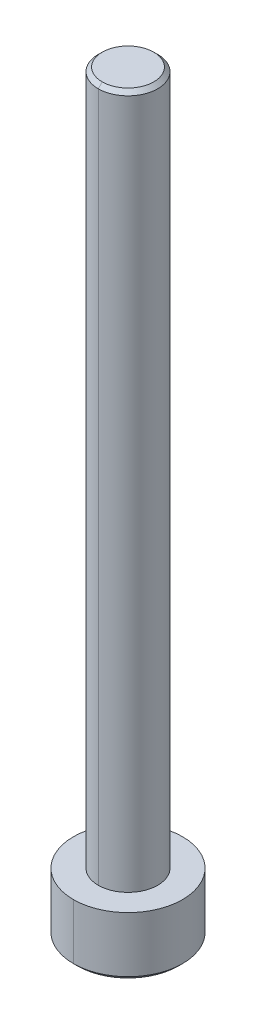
ISO-10303-21;
HEADER;
FILE_DESCRIPTION(('STEP AP214'),'2;1');
FILE_NAME('part.step','',(''),(''),'','','');
FILE_SCHEMA(('AUTOMOTIVE_DESIGN { 1 0 10303 214 1 1 1 1 }'));
ENDSEC;
DATA;
#1=APPLICATION_CONTEXT('core data for automotive mechanical design processes');
#2=APPLICATION_PROTOCOL_DEFINITION('international standard','automotive_design',2000,#1);
#3=PRODUCT_CONTEXT('',#1,'mechanical');
#4=PRODUCT('Part','Part','',(#3));
#5=PRODUCT_RELATED_PRODUCT_CATEGORY('part','',(#4));
#6=PRODUCT_DEFINITION_FORMATION('','',#4);
#7=PRODUCT_DEFINITION_CONTEXT('part definition',#1,'design');
#8=PRODUCT_DEFINITION('design','',#6,#7);
#9=PRODUCT_DEFINITION_SHAPE('','',#8);
#10=(LENGTH_UNIT() NAMED_UNIT(*) SI_UNIT(.MILLI.,.METRE.));
#11=(NAMED_UNIT(*) PLANE_ANGLE_UNIT() SI_UNIT($,.RADIAN.));
#12=(NAMED_UNIT(*) SI_UNIT($,.STERADIAN.) SOLID_ANGLE_UNIT());
#13=UNCERTAINTY_MEASURE_WITH_UNIT(LENGTH_MEASURE(1.E-05),#10,'distance_accuracy_value','');
#14=(GEOMETRIC_REPRESENTATION_CONTEXT(3) GLOBAL_UNCERTAINTY_ASSIGNED_CONTEXT((#13)) GLOBAL_UNIT_ASSIGNED_CONTEXT((#10,
#11,#12)) REPRESENTATION_CONTEXT('',''));
#15=CARTESIAN_POINT('',(0.,0.,0.));
#16=DIRECTION('',(0.,0.,1.));
#17=DIRECTION('',(1.,0.,0.));
#18=AXIS2_PLACEMENT_3D('',#15,#16,#17);
#19=CARTESIAN_POINT('',(-27.97508868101,-72.,27.975088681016));
#20=DIRECTION('',(0.,-1.,0.));
#21=DIRECTION('',(-1.,0.,0.));
#22=AXIS2_PLACEMENT_3D('',#19,#20,#21);
#23=PLANE('',#22);
#24=DIRECTION('',(-0.50000000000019,0.,-0.866025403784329));
#25=VECTOR('',#24,1.);
#26=CARTESIAN_POINT('',(-27.25340084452,-72.,26.725088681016));
#27=LINE('',#26,#25);
#28=CARTESIAN_POINT('',(-26.53171300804,-72.,27.975088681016));
#29=VERTEX_POINT('',#28);
#30=CARTESIAN_POINT('',(-27.25340084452,-72.,26.725088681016));
#31=VERTEX_POINT('',#30);
#32=EDGE_CURVE('E215',#29,#31,#27,.T.);
#33=ORIENTED_EDGE('',*,*,#32,.F.);
#34=DIRECTION('',(0.50000000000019,0.,-0.866025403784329));
#35=VECTOR('',#34,1.);
#36=CARTESIAN_POINT('',(-26.53171300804,-72.,27.975088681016));
#37=LINE('',#36,#35);
#38=CARTESIAN_POINT('',(-27.25340084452,-72.,29.225088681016));
#39=VERTEX_POINT('',#38);
#40=EDGE_CURVE('E10',#39,#29,#37,.T.);
#41=ORIENTED_EDGE('',*,*,#40,.F.);
#42=DIRECTION('',(1.,0.,0.));
#43=VECTOR('',#42,1.);
#44=CARTESIAN_POINT('',(-27.25340084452,-72.,29.225088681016));
#45=LINE('',#44,#43);
#46=CARTESIAN_POINT('',(-28.6967765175,-72.,29.225088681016));
#47=VERTEX_POINT('',#46);
#48=EDGE_CURVE('E167',#47,#39,#45,.T.);
#49=ORIENTED_EDGE('',*,*,#48,.F.);
#50=DIRECTION('',(0.50000000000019,0.,0.866025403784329));
#51=VECTOR('',#50,1.);
#52=CARTESIAN_POINT('',(-28.6967765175,-72.,29.225088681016));
#53=LINE('',#52,#51);
#54=CARTESIAN_POINT('',(-29.41846435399,-72.,27.975088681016));
#55=VERTEX_POINT('',#54);
#56=EDGE_CURVE('E183',#55,#47,#53,.T.);
#57=ORIENTED_EDGE('',*,*,#56,.F.);
#58=DIRECTION('',(-0.50000000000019,0.,0.866025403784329));
#59=VECTOR('',#58,1.);
#60=CARTESIAN_POINT('',(-29.41846435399,-72.,27.975088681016));
#61=LINE('',#60,#59);
#62=CARTESIAN_POINT('',(-28.6967765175,-72.,26.725088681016));
#63=VERTEX_POINT('',#62);
#64=EDGE_CURVE('E207',#63,#55,#61,.T.);
#65=ORIENTED_EDGE('',*,*,#64,.F.);
#66=DIRECTION('',(-1.,0.,0.));
#67=VECTOR('',#66,1.);
#68=CARTESIAN_POINT('',(-28.6967765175,-72.,26.725088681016));
#69=LINE('',#68,#67);
#70=EDGE_CURVE('E208',#31,#63,#69,.T.);
#71=ORIENTED_EDGE('',*,*,#70,.F.);
#72=EDGE_LOOP('',(#33,#41,#49,#57,#65,#71));
#73=FACE_BOUND('',#72,.T.);
#74=ADVANCED_FACE('F16',(#73),#23,.T.);
#75=CARTESIAN_POINT('',(-26.53171300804,-72.,27.975088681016));
#76=DIRECTION('',(-0.866025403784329,0.,-0.50000000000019));
#77=DIRECTION('',(-0.50000000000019,0.,0.866025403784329));
#78=AXIS2_PLACEMENT_3D('',#75,#76,#77);
#79=PLANE('',#78);
#80=DIRECTION('',(0.50000000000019,0.,-0.866025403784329));
#81=VECTOR('',#80,1.);
#82=CARTESIAN_POINT('',(-26.53171300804,-73.5,27.975088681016));
#83=LINE('',#82,#81);
#84=CARTESIAN_POINT('',(-27.25340084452,-73.5,29.225088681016));
#85=VERTEX_POINT('',#84);
#86=CARTESIAN_POINT('',(-26.53171300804,-73.5,27.975088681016));
#87=VERTEX_POINT('',#86);
#88=EDGE_CURVE('E137',#85,#87,#83,.T.);
#89=ORIENTED_EDGE('',*,*,#88,.F.);
#90=DIRECTION('',(0.,-1.,0.));
#91=VECTOR('',#90,1.);
#92=CARTESIAN_POINT('',(-27.25340084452,-72.,29.225088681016));
#93=LINE('',#92,#91);
#94=EDGE_CURVE('E27',#39,#85,#93,.T.);
#95=ORIENTED_EDGE('',*,*,#94,.F.);
#96=ORIENTED_EDGE('',*,*,#40,.T.);
#97=DIRECTION('',(0.,-1.,0.));
#98=VECTOR('',#97,1.);
#99=CARTESIAN_POINT('',(-26.53171300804,-72.,27.975088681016));
#100=LINE('',#99,#98);
#101=EDGE_CURVE('E212',#29,#87,#100,.T.);
#102=ORIENTED_EDGE('',*,*,#101,.T.);
#103=EDGE_LOOP('',(#89,#95,#96,#102));
#104=FACE_BOUND('',#103,.T.);
#105=ADVANCED_FACE('F317',(#104),#79,.T.);
#106=CARTESIAN_POINT('',(-27.25340084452,-72.,29.225088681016));
#107=DIRECTION('',(0.,0.,-1.));
#108=DIRECTION('',(-1.,0.,0.));
#109=AXIS2_PLACEMENT_3D('',#106,#107,#108);
#110=PLANE('',#109);
#111=DIRECTION('',(1.,0.,0.));
#112=VECTOR('',#111,1.);
#113=CARTESIAN_POINT('',(-27.25340084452,-73.5,29.225088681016));
#114=LINE('',#113,#112);
#115=CARTESIAN_POINT('',(-28.6967765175,-73.5,29.225088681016));
#116=VERTEX_POINT('',#115);
#117=EDGE_CURVE('E230',#116,#85,#114,.T.);
#118=ORIENTED_EDGE('',*,*,#117,.F.);
#119=DIRECTION('',(0.,-1.,0.));
#120=VECTOR('',#119,1.);
#121=CARTESIAN_POINT('',(-28.6967765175,-72.,29.225088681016));
#122=LINE('',#121,#120);
#123=EDGE_CURVE('E170',#47,#116,#122,.T.);
#124=ORIENTED_EDGE('',*,*,#123,.F.);
#125=ORIENTED_EDGE('',*,*,#48,.T.);
#126=ORIENTED_EDGE('',*,*,#94,.T.);
#127=EDGE_LOOP('',(#118,#124,#125,#126));
#128=FACE_BOUND('',#127,.T.);
#129=ADVANCED_FACE('F264',(#128),#110,.T.);
#130=CARTESIAN_POINT('',(-28.6967765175,-72.,29.225088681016));
#131=DIRECTION('',(0.866025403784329,0.,-0.50000000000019));
#132=DIRECTION('',(0.,-1.,0.));
#133=AXIS2_PLACEMENT_3D('',#130,#131,#132);
#134=PLANE('',#133);
#135=DIRECTION('',(0.50000000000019,0.,0.866025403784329));
#136=VECTOR('',#135,1.);
#137=CARTESIAN_POINT('',(-28.6967765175,-73.5,29.225088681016));
#138=LINE('',#137,#136);
#139=CARTESIAN_POINT('',(-29.41846435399,-73.5,27.975088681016));
#140=VERTEX_POINT('',#139);
#141=EDGE_CURVE('E226',#140,#116,#138,.T.);
#142=ORIENTED_EDGE('',*,*,#141,.F.);
#143=DIRECTION('',(0.,-1.,0.));
#144=VECTOR('',#143,1.);
#145=CARTESIAN_POINT('',(-29.41846435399,-72.,27.975088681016));
#146=LINE('',#145,#144);
#147=EDGE_CURVE('E187',#55,#140,#146,.T.);
#148=ORIENTED_EDGE('',*,*,#147,.F.);
#149=ORIENTED_EDGE('',*,*,#56,.T.);
#150=ORIENTED_EDGE('',*,*,#123,.T.);
#151=EDGE_LOOP('',(#142,#148,#149,#150));
#152=FACE_BOUND('',#151,.T.);
#153=ADVANCED_FACE('F260',(#152),#134,.T.);
#154=CARTESIAN_POINT('',(-29.41846435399,-72.,27.975088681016));
#155=DIRECTION('',(0.866025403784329,0.,0.50000000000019));
#156=DIRECTION('',(0.,-1.,0.));
#157=AXIS2_PLACEMENT_3D('',#154,#155,#156);
#158=PLANE('',#157);
#159=DIRECTION('',(-0.50000000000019,0.,0.866025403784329));
#160=VECTOR('',#159,1.);
#161=CARTESIAN_POINT('',(-29.41846435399,-73.5,27.975088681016));
#162=LINE('',#161,#160);
#163=CARTESIAN_POINT('',(-28.6967765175,-73.5,26.725088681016));
#164=VERTEX_POINT('',#163);
#165=EDGE_CURVE('E161',#164,#140,#162,.T.);
#166=ORIENTED_EDGE('',*,*,#165,.F.);
#167=DIRECTION('',(0.,-1.,0.));
#168=VECTOR('',#167,1.);
#169=CARTESIAN_POINT('',(-28.6967765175,-72.,26.725088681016));
#170=LINE('',#169,#168);
#171=EDGE_CURVE('E205',#63,#164,#170,.T.);
#172=ORIENTED_EDGE('',*,*,#171,.F.);
#173=ORIENTED_EDGE('',*,*,#64,.T.);
#174=ORIENTED_EDGE('',*,*,#147,.T.);
#175=EDGE_LOOP('',(#166,#172,#173,#174));
#176=FACE_BOUND('',#175,.T.);
#177=ADVANCED_FACE('F345',(#176),#158,.T.);
#178=CARTESIAN_POINT('',(-28.6967765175,-72.,26.725088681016));
#179=DIRECTION('',(0.,0.,1.));
#180=DIRECTION('',(1.,0.,0.));
#181=AXIS2_PLACEMENT_3D('',#178,#179,#180);
#182=PLANE('',#181);
#183=DIRECTION('',(-1.,0.,0.));
#184=VECTOR('',#183,1.);
#185=CARTESIAN_POINT('',(-28.6967765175,-73.5,26.725088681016));
#186=LINE('',#185,#184);
#187=CARTESIAN_POINT('',(-27.25340084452,-73.5,26.725088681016));
#188=VERTEX_POINT('',#187);
#189=EDGE_CURVE('E188',#188,#164,#186,.T.);
#190=ORIENTED_EDGE('',*,*,#189,.F.);
#191=DIRECTION('',(0.,-1.,0.));
#192=VECTOR('',#191,1.);
#193=CARTESIAN_POINT('',(-27.25340084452,-72.,26.725088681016));
#194=LINE('',#193,#192);
#195=EDGE_CURVE('E246',#31,#188,#194,.T.);
#196=ORIENTED_EDGE('',*,*,#195,.F.);
#197=ORIENTED_EDGE('',*,*,#70,.T.);
#198=ORIENTED_EDGE('',*,*,#171,.T.);
#199=EDGE_LOOP('',(#190,#196,#197,#198));
#200=FACE_BOUND('',#199,.T.);
#201=ADVANCED_FACE('F337',(#200),#182,.T.);
#202=CARTESIAN_POINT('',(-27.25340084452,-72.,26.725088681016));
#203=DIRECTION('',(-0.866025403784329,0.,0.50000000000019));
#204=DIRECTION('',(0.,1.,0.));
#205=AXIS2_PLACEMENT_3D('',#202,#203,#204);
#206=PLANE('',#205);
#207=DIRECTION('',(-0.50000000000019,0.,-0.866025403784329));
#208=VECTOR('',#207,1.);
#209=CARTESIAN_POINT('',(-27.25340084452,-73.5,26.725088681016));
#210=LINE('',#209,#208);
#211=EDGE_CURVE('E192',#87,#188,#210,.T.);
#212=ORIENTED_EDGE('',*,*,#211,.F.);
#213=ORIENTED_EDGE('',*,*,#101,.F.);
#214=ORIENTED_EDGE('',*,*,#32,.T.);
#215=ORIENTED_EDGE('',*,*,#195,.T.);
#216=EDGE_LOOP('',(#212,#213,#214,#215));
#217=FACE_BOUND('',#216,.T.);
#218=ADVANCED_FACE('F335',(#217),#206,.T.);
#219=CARTESIAN_POINT('',(-26.67508868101,-35.5,27.975088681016));
#220=DIRECTION('',(0.,1.,0.));
#221=DIRECTION('',(0.,0.,-1.));
#222=AXIS2_PLACEMENT_3D('',#219,#220,#221);
#223=PLANE('',#222);
#224=CARTESIAN_POINT('',(-27.97508868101,-35.5,27.975088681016));
#225=DIRECTION('',(0.,-1.,0.));
#226=DIRECTION('',(0.,0.,-1.));
#227=AXIS2_PLACEMENT_3D('',#224,#225,#226);
#228=CIRCLE('',#227,1.3);
#229=CARTESIAN_POINT('',(-27.97508868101,-35.5,26.675088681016));
#230=VERTEX_POINT('',#229);
#231=CARTESIAN_POINT('',(-27.97508868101,-35.5,29.275088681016));
#232=VERTEX_POINT('',#231);
#233=EDGE_CURVE('E236',#230,#232,#228,.T.);
#234=ORIENTED_EDGE('',*,*,#233,.F.);
#235=CARTESIAN_POINT('',(-27.97508868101,-35.5,27.975088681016));
#236=DIRECTION('',(0.,-1.,0.));
#237=DIRECTION('',(0.,0.,-1.));
#238=AXIS2_PLACEMENT_3D('',#235,#236,#237);
#239=CIRCLE('',#238,1.3);
#240=EDGE_CURVE('E20',#232,#230,#239,.T.);
#241=ORIENTED_EDGE('',*,*,#240,.F.);
#242=EDGE_LOOP('',(#234,#241));
#243=FACE_BOUND('',#242,.T.);
#244=ADVANCED_FACE('F333',(#243),#223,.T.);
#245=CARTESIAN_POINT('',(-27.97508868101,-35.7,27.975088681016));
#246=DIRECTION('',(0.,-1.,0.));
#247=DIRECTION('',(0.,0.,-1.));
#248=AXIS2_PLACEMENT_3D('',#245,#246,#247);
#249=CONICAL_SURFACE('',#248,1.5,0.785398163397);
#250=DIRECTION('',(0.,-0.707106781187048,0.707106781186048));
#251=VECTOR('',#250,1.);
#252=CARTESIAN_POINT('',(-27.97508868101,-35.7,29.475088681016));
#253=LINE('',#252,#251);
#254=CARTESIAN_POINT('',(-27.97508868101,-35.7,29.475088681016));
#255=VERTEX_POINT('',#254);
#256=EDGE_CURVE('E225',#232,#255,#253,.T.);
#257=ORIENTED_EDGE('',*,*,#256,.F.);
#258=ORIENTED_EDGE('',*,*,#240,.T.);
#259=DIRECTION('',(0.,-0.707106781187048,-0.707106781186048));
#260=VECTOR('',#259,1.);
#261=CARTESIAN_POINT('',(-27.97508868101,-35.7,26.475088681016));
#262=LINE('',#261,#260);
#263=CARTESIAN_POINT('',(-27.97508868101,-35.7,26.475088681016));
#264=VERTEX_POINT('',#263);
#265=EDGE_CURVE('E175',#230,#264,#262,.T.);
#266=ORIENTED_EDGE('',*,*,#265,.T.);
#267=CARTESIAN_POINT('',(-27.97508868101,-35.7,27.975088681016));
#268=DIRECTION('',(0.,-1.,0.));
#269=DIRECTION('',(0.,0.,-1.));
#270=AXIS2_PLACEMENT_3D('',#267,#268,#269);
#271=CIRCLE('',#270,1.5);
#272=EDGE_CURVE('E165',#255,#264,#271,.T.);
#273=ORIENTED_EDGE('',*,*,#272,.F.);
#274=EDGE_LOOP('',(#257,#258,#266,#273));
#275=FACE_BOUND('',#274,.T.);
#276=ADVANCED_FACE('F311',(#275),#249,.T.);
#277=CARTESIAN_POINT('',(-27.97508868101,-570.5,27.975088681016));
#278=DIRECTION('',(0.,-1.,0.));
#279=DIRECTION('',(0.,0.,-1.));
#280=AXIS2_PLACEMENT_3D('',#277,#278,#279);
#281=CYLINDRICAL_SURFACE('',#280,1.5);
#282=DIRECTION('',(0.,-1.,0.));
#283=VECTOR('',#282,1.);
#284=CARTESIAN_POINT('',(-27.97508868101,-570.5,29.475088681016));
#285=LINE('',#284,#283);
#286=CARTESIAN_POINT('',(-27.97508868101,-70.5,29.475088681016));
#287=VERTEX_POINT('',#286);
#288=EDGE_CURVE('E179',#255,#287,#285,.T.);
#289=ORIENTED_EDGE('',*,*,#288,.F.);
#290=ORIENTED_EDGE('',*,*,#272,.T.);
#291=DIRECTION('',(0.,-1.,0.));
#292=VECTOR('',#291,1.);
#293=CARTESIAN_POINT('',(-27.97508868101,-570.5,26.475088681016));
#294=LINE('',#293,#292);
#295=CARTESIAN_POINT('',(-27.97508868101,-70.5,26.475088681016));
#296=VERTEX_POINT('',#295);
#297=EDGE_CURVE('E204',#264,#296,#294,.T.);
#298=ORIENTED_EDGE('',*,*,#297,.T.);
#299=CARTESIAN_POINT('',(-27.97508868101,-70.5,27.975088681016));
#300=DIRECTION('',(0.,-1.,0.));
#301=DIRECTION('',(0.,0.,-1.));
#302=AXIS2_PLACEMENT_3D('',#299,#300,#301);
#303=CIRCLE('',#302,1.5);
#304=EDGE_CURVE('E163',#287,#296,#303,.T.);
#305=ORIENTED_EDGE('',*,*,#304,.F.);
#306=EDGE_LOOP('',(#289,#290,#298,#305));
#307=FACE_BOUND('',#306,.T.);
#308=ADVANCED_FACE('F296',(#307),#281,.T.);
#309=CARTESIAN_POINT('',(-25.22508868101,-70.5,27.975088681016));
#310=DIRECTION('',(0.,1.,0.));
#311=DIRECTION('',(0.,0.,-1.));
#312=AXIS2_PLACEMENT_3D('',#309,#310,#311);
#313=PLANE('',#312);
#314=CARTESIAN_POINT('',(-27.97508868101,-70.5,27.975088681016));
#315=DIRECTION('',(0.,-1.,0.));
#316=DIRECTION('',(0.,0.,-1.));
#317=AXIS2_PLACEMENT_3D('',#314,#315,#316);
#318=CIRCLE('',#317,2.75);
#319=CARTESIAN_POINT('',(-27.97508868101,-70.5,25.225088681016));
#320=VERTEX_POINT('',#319);
#321=CARTESIAN_POINT('',(-27.97508868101,-70.5,30.725088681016));
#322=VERTEX_POINT('',#321);
#323=EDGE_CURVE('E196',#320,#322,#318,.T.);
#324=ORIENTED_EDGE('',*,*,#323,.F.);
#325=CARTESIAN_POINT('',(-27.97508868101,-70.5,27.975088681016));
#326=DIRECTION('',(0.,-1.,0.));
#327=DIRECTION('',(0.,0.,-1.));
#328=AXIS2_PLACEMENT_3D('',#325,#326,#327);
#329=CIRCLE('',#328,2.75);
#330=EDGE_CURVE('E166',#322,#320,#329,.T.);
#331=ORIENTED_EDGE('',*,*,#330,.F.);
#332=EDGE_LOOP('',(#324,#331));
#333=FACE_BOUND('',#332,.T.);
#334=CARTESIAN_POINT('',(-27.97508868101,-70.5,27.975088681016));
#335=DIRECTION('',(0.,-1.,0.));
#336=DIRECTION('',(0.,0.,-1.));
#337=AXIS2_PLACEMENT_3D('',#334,#335,#336);
#338=CIRCLE('',#337,1.5);
#339=EDGE_CURVE('E200',#296,#287,#338,.T.);
#340=ORIENTED_EDGE('',*,*,#339,.T.);
#341=ORIENTED_EDGE('',*,*,#304,.T.);
#342=EDGE_LOOP('',(#340,#341));
#343=FACE_BOUND('',#342,.T.);
#344=ADVANCED_FACE('F299',(#333,#343),#313,.T.);
#345=CARTESIAN_POINT('',(-27.97508868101,-570.5,27.975088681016));
#346=DIRECTION('',(0.,-1.,0.));
#347=DIRECTION('',(0.,0.,-1.));
#348=AXIS2_PLACEMENT_3D('',#345,#346,#347);
#349=CYLINDRICAL_SURFACE('',#348,2.75);
#350=DIRECTION('',(0.,-1.,0.));
#351=VECTOR('',#350,1.);
#352=CARTESIAN_POINT('',(-27.97508868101,-570.5,30.725088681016));
#353=LINE('',#352,#351);
#354=CARTESIAN_POINT('',(-27.97508868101,-73.3,30.725088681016));
#355=VERTEX_POINT('',#354);
#356=EDGE_CURVE('E174',#322,#355,#353,.T.);
#357=ORIENTED_EDGE('',*,*,#356,.F.);
#358=ORIENTED_EDGE('',*,*,#330,.T.);
#359=DIRECTION('',(0.,-1.,0.));
#360=VECTOR('',#359,1.);
#361=CARTESIAN_POINT('',(-27.97508868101,-570.5,25.225088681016));
#362=LINE('',#361,#360);
#363=CARTESIAN_POINT('',(-27.97508868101,-73.3,25.225088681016));
#364=VERTEX_POINT('',#363);
#365=EDGE_CURVE('E151',#320,#364,#362,.T.);
#366=ORIENTED_EDGE('',*,*,#365,.T.);
#367=CARTESIAN_POINT('',(-27.97508868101,-73.3,27.975088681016));
#368=DIRECTION('',(0.,-1.,0.));
#369=DIRECTION('',(0.,0.,-1.));
#370=AXIS2_PLACEMENT_3D('',#367,#368,#369);
#371=CIRCLE('',#370,2.75);
#372=EDGE_CURVE('E143',#355,#364,#371,.T.);
#373=ORIENTED_EDGE('',*,*,#372,.F.);
#374=EDGE_LOOP('',(#357,#358,#366,#373));
#375=FACE_BOUND('',#374,.T.);
#376=ADVANCED_FACE('F301',(#375),#349,.T.);
#377=CARTESIAN_POINT('',(-27.97508868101,-73.5,27.975088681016));
#378=DIRECTION('',(0.,1.,0.));
#379=DIRECTION('',(0.,0.,1.));
#380=AXIS2_PLACEMENT_3D('',#377,#378,#379);
#381=CONICAL_SURFACE('',#380,2.55,0.785398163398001);
#382=DIRECTION('',(0.,0.707106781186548,-0.707106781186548));
#383=VECTOR('',#382,1.);
#384=CARTESIAN_POINT('',(-27.97508868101,-73.5,25.425088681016));
#385=LINE('',#384,#383);
#386=CARTESIAN_POINT('',(-27.97508868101,-73.5,25.425088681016));
#387=VERTEX_POINT('',#386);
#388=EDGE_CURVE('E141',#387,#364,#385,.T.);
#389=ORIENTED_EDGE('',*,*,#388,.F.);
#390=CARTESIAN_POINT('',(-27.97508868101,-73.5,27.975088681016));
#391=DIRECTION('',(0.,-1.,0.));
#392=DIRECTION('',(0.,0.,-1.));
#393=AXIS2_PLACEMENT_3D('',#390,#391,#392);
#394=CIRCLE('',#393,2.55);
#395=CARTESIAN_POINT('',(-27.97508868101,-73.5,30.525088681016));
#396=VERTEX_POINT('',#395);
#397=EDGE_CURVE('E128',#396,#387,#394,.T.);
#398=ORIENTED_EDGE('',*,*,#397,.F.);
#399=DIRECTION('',(0.,0.707106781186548,0.707106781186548));
#400=VECTOR('',#399,1.);
#401=CARTESIAN_POINT('',(-27.97508868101,-73.5,30.525088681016));
#402=LINE('',#401,#400);
#403=EDGE_CURVE('E138',#396,#355,#402,.T.);
#404=ORIENTED_EDGE('',*,*,#403,.T.);
#405=ORIENTED_EDGE('',*,*,#372,.T.);
#406=EDGE_LOOP('',(#389,#398,#404,#405));
#407=FACE_BOUND('',#406,.T.);
#408=ADVANCED_FACE('F142',(#407),#381,.T.);
#409=CARTESIAN_POINT('',(-27.97508868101,-73.5,27.975088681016));
#410=DIRECTION('',(0.,-1.,0.));
#411=DIRECTION('',(-1.,0.,0.));
#412=AXIS2_PLACEMENT_3D('',#409,#410,#411);
#413=PLANE('',#412);
#414=ORIENTED_EDGE('',*,*,#88,.T.);
#415=ORIENTED_EDGE('',*,*,#211,.T.);
#416=ORIENTED_EDGE('',*,*,#189,.T.);
#417=ORIENTED_EDGE('',*,*,#165,.T.);
#418=ORIENTED_EDGE('',*,*,#141,.T.);
#419=ORIENTED_EDGE('',*,*,#117,.T.);
#420=EDGE_LOOP('',(#414,#415,#416,#417,#418,#419));
#421=FACE_BOUND('',#420,.T.);
#422=ORIENTED_EDGE('',*,*,#397,.T.);
#423=CARTESIAN_POINT('',(-27.97508868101,-73.5,27.975088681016));
#424=DIRECTION('',(0.,-1.,0.));
#425=DIRECTION('',(0.,0.,-1.));
#426=AXIS2_PLACEMENT_3D('',#423,#424,#425);
#427=CIRCLE('',#426,2.55);
#428=EDGE_CURVE('E132',#387,#396,#427,.T.);
#429=ORIENTED_EDGE('',*,*,#428,.T.);
#430=EDGE_LOOP('',(#422,#429));
#431=FACE_BOUND('',#430,.T.);
#432=ADVANCED_FACE('F130',(#421,#431),#413,.T.);
#433=CARTESIAN_POINT('',(-27.97508868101,-73.5,27.975088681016));
#434=DIRECTION('',(0.,1.,0.));
#435=DIRECTION('',(0.,0.,1.));
#436=AXIS2_PLACEMENT_3D('',#433,#434,#435);
#437=CONICAL_SURFACE('',#436,2.55,0.785398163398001);
#438=ORIENTED_EDGE('',*,*,#428,.F.);
#439=ORIENTED_EDGE('',*,*,#388,.T.);
#440=CARTESIAN_POINT('',(-27.97508868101,-73.3,27.975088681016));
#441=DIRECTION('',(0.,-1.,0.));
#442=DIRECTION('',(0.,0.,-1.));
#443=AXIS2_PLACEMENT_3D('',#440,#441,#442);
#444=CIRCLE('',#443,2.75);
#445=EDGE_CURVE('E157',#364,#355,#444,.T.);
#446=ORIENTED_EDGE('',*,*,#445,.T.);
#447=ORIENTED_EDGE('',*,*,#403,.F.);
#448=EDGE_LOOP('',(#438,#439,#446,#447));
#449=FACE_BOUND('',#448,.T.);
#450=ADVANCED_FACE('F149',(#449),#437,.T.);
#451=CARTESIAN_POINT('',(-27.97508868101,-570.5,27.975088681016));
#452=DIRECTION('',(0.,-1.,0.));
#453=DIRECTION('',(0.,0.,-1.));
#454=AXIS2_PLACEMENT_3D('',#451,#452,#453);
#455=CYLINDRICAL_SURFACE('',#454,2.75);
#456=ORIENTED_EDGE('',*,*,#323,.T.);
#457=ORIENTED_EDGE('',*,*,#356,.T.);
#458=ORIENTED_EDGE('',*,*,#445,.F.);
#459=ORIENTED_EDGE('',*,*,#365,.F.);
#460=EDGE_LOOP('',(#456,#457,#458,#459));
#461=FACE_BOUND('',#460,.T.);
#462=ADVANCED_FACE('F352',(#461),#455,.T.);
#463=CARTESIAN_POINT('',(-27.97508868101,-570.5,27.975088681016));
#464=DIRECTION('',(0.,-1.,0.));
#465=DIRECTION('',(0.,0.,-1.));
#466=AXIS2_PLACEMENT_3D('',#463,#464,#465);
#467=CYLINDRICAL_SURFACE('',#466,1.5);
#468=CARTESIAN_POINT('',(-27.97508868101,-35.7,27.975088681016));
#469=DIRECTION('',(0.,-1.,0.));
#470=DIRECTION('',(0.,0.,-1.));
#471=AXIS2_PLACEMENT_3D('',#468,#469,#470);
#472=CIRCLE('',#471,1.5);
#473=EDGE_CURVE('E180',#264,#255,#472,.T.);
#474=ORIENTED_EDGE('',*,*,#473,.T.);
#475=ORIENTED_EDGE('',*,*,#288,.T.);
#476=ORIENTED_EDGE('',*,*,#339,.F.);
#477=ORIENTED_EDGE('',*,*,#297,.F.);
#478=EDGE_LOOP('',(#474,#475,#476,#477));
#479=FACE_BOUND('',#478,.T.);
#480=ADVANCED_FACE('F18',(#479),#467,.T.);
#481=CARTESIAN_POINT('',(-27.97508868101,-35.7,27.975088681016));
#482=DIRECTION('',(0.,-1.,0.));
#483=DIRECTION('',(0.,0.,-1.));
#484=AXIS2_PLACEMENT_3D('',#481,#482,#483);
#485=CONICAL_SURFACE('',#484,1.5,0.785398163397);
#486=ORIENTED_EDGE('',*,*,#233,.T.);
#487=ORIENTED_EDGE('',*,*,#256,.T.);
#488=ORIENTED_EDGE('',*,*,#473,.F.);
#489=ORIENTED_EDGE('',*,*,#265,.F.);
#490=EDGE_LOOP('',(#486,#487,#488,#489));
#491=FACE_BOUND('',#490,.T.);
#492=ADVANCED_FACE('F325',(#491),#485,.T.);
#493=CLOSED_SHELL('',(#74,#105,#129,#153,#177,#201,#218,#244,#276,#308,#344,#376,#408,#432,#450,
#462,#480,#492));
#494=MANIFOLD_SOLID_BREP('B1',#493);
#495=ADVANCED_BREP_SHAPE_REPRESENTATION('',(#18,#494),#14);
#496=SHAPE_DEFINITION_REPRESENTATION(#9,#495);
ENDSEC;
END-ISO-10303-21;
